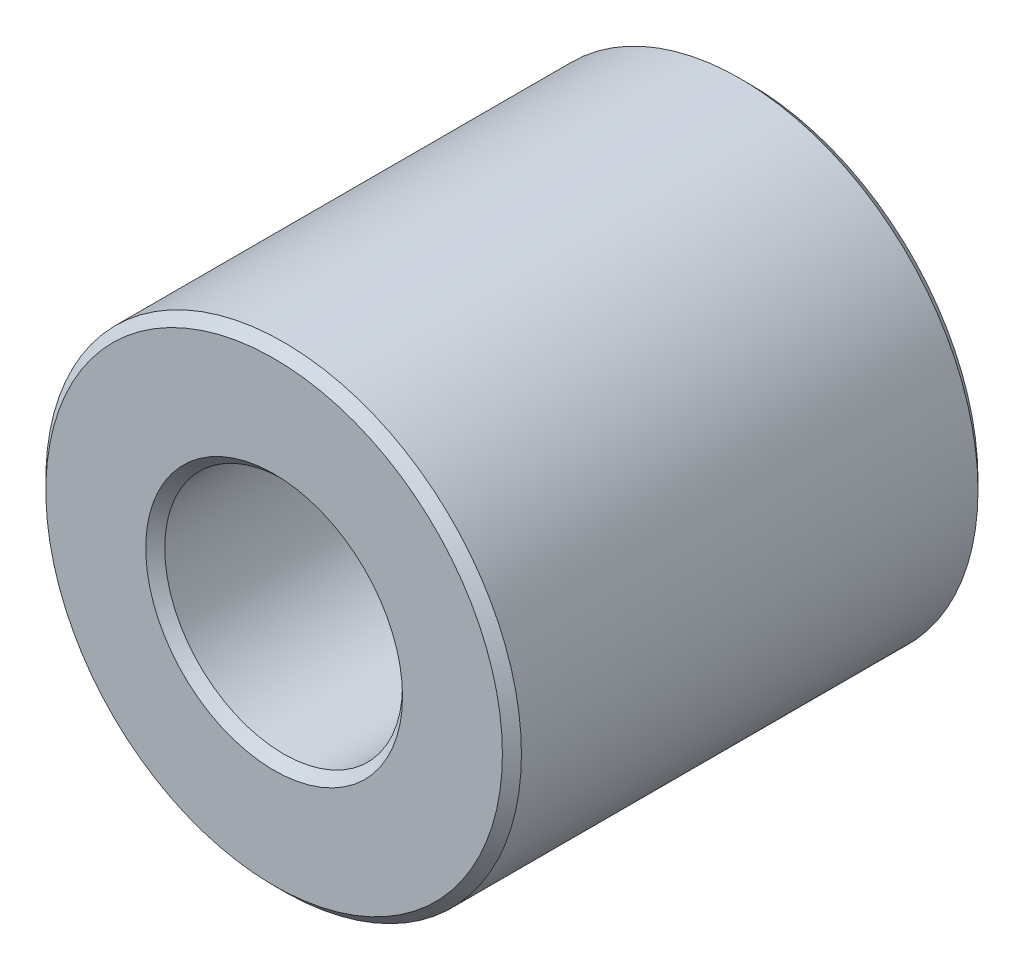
from build123d import *

# Parameters (mm, degrees)
SKETCH1_R           = 2.5
SKETCH1_R_2         = 1.25
BOSS_EXTRUDE2_DEPTH = 2.5
CHAMFER3_SIZE       = 0.1


with BuildPart() as part:
    # Sketch1 → Boss-Extrude2 (new, symmetric)
    with BuildSketch(Plane.XY):
        Circle(SKETCH1_R)
        Circle(SKETCH1_R_2, mode=Mode.SUBTRACT)
    extrude(amount=BOSS_EXTRUDE2_DEPTH, both=True)

    # Chamfer3
    chamfer3_edges = [part.edges().sort_by_distance(p)[0] for p in [
        (-2.5, 0, -2.5),
        (-2.5, 0, 2.5),
        (-1.25, 0, -2.5),
        (-1.25, 0, 2.5),
    ]]
    chamfer(chamfer3_edges, length=CHAMFER3_SIZE)


solid = part.part
